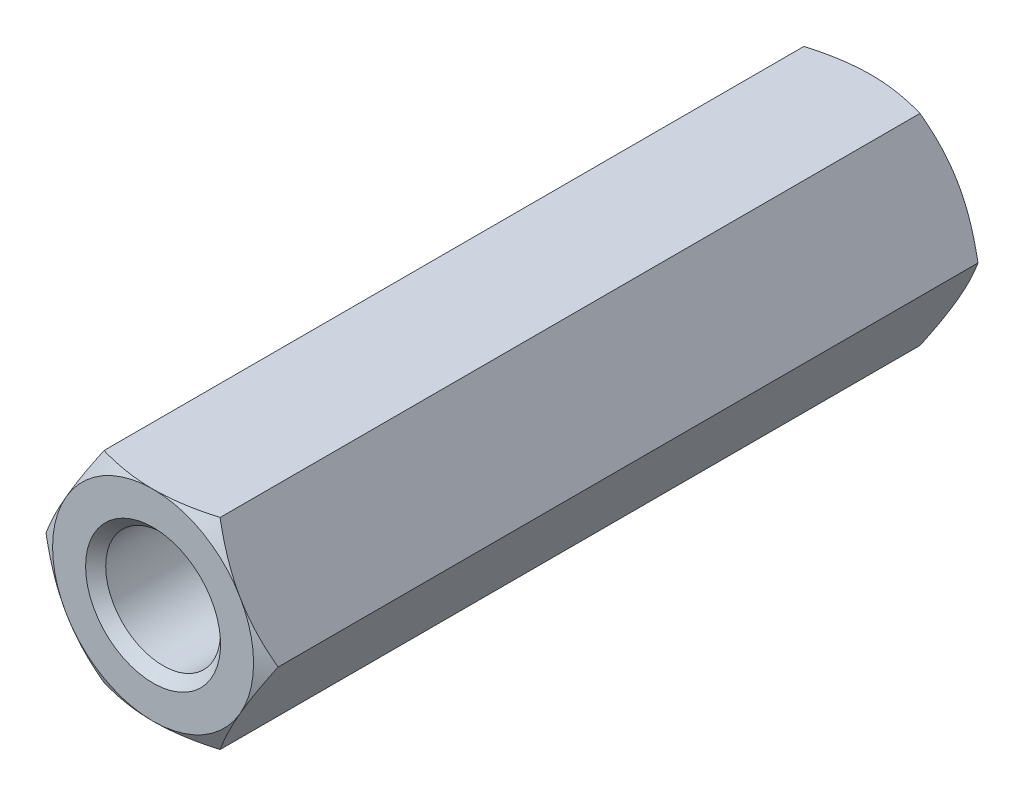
ISO-10303-21;
HEADER;
FILE_DESCRIPTION(('STEP AP214'),'2;1');
FILE_NAME('part.step','',(''),(''),'','','');
FILE_SCHEMA(('AUTOMOTIVE_DESIGN { 1 0 10303 214 1 1 1 1 }'));
ENDSEC;
DATA;
#1=APPLICATION_CONTEXT('core data for automotive mechanical design processes');
#2=APPLICATION_PROTOCOL_DEFINITION('international standard','automotive_design',2000,#1);
#3=PRODUCT_CONTEXT('',#1,'mechanical');
#4=PRODUCT('Part','Part','',(#3));
#5=PRODUCT_RELATED_PRODUCT_CATEGORY('part','',(#4));
#6=PRODUCT_DEFINITION_FORMATION('','',#4);
#7=PRODUCT_DEFINITION_CONTEXT('part definition',#1,'design');
#8=PRODUCT_DEFINITION('design','',#6,#7);
#9=PRODUCT_DEFINITION_SHAPE('','',#8);
#10=(LENGTH_UNIT() NAMED_UNIT(*) SI_UNIT(.MILLI.,.METRE.));
#11=(NAMED_UNIT(*) PLANE_ANGLE_UNIT() SI_UNIT($,.RADIAN.));
#12=(NAMED_UNIT(*) SI_UNIT($,.STERADIAN.) SOLID_ANGLE_UNIT());
#13=UNCERTAINTY_MEASURE_WITH_UNIT(LENGTH_MEASURE(1.E-05),#10,'distance_accuracy_value','');
#14=(GEOMETRIC_REPRESENTATION_CONTEXT(3) GLOBAL_UNCERTAINTY_ASSIGNED_CONTEXT((#13)) GLOBAL_UNIT_ASSIGNED_CONTEXT((#10,
#11,#12)) REPRESENTATION_CONTEXT('',''));
#15=CARTESIAN_POINT('',(0.,0.,0.));
#16=DIRECTION('',(0.,0.,1.));
#17=DIRECTION('',(1.,0.,0.));
#18=AXIS2_PLACEMENT_3D('',#15,#16,#17);
#19=CARTESIAN_POINT('',(4.04145188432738,0.,-12.5));
#20=DIRECTION('',(0.866025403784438,0.5,0.));
#21=DIRECTION('',(-0.5,0.866025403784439,0.));
#22=AXIS2_PLACEMENT_3D('',#19,#20,#21);
#23=PLANE('',#22);
#24=CARTESIAN_POINT('',(4.04156735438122,-0.00019999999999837,12.1873259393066));
#25=CARTESIAN_POINT('',(3.9527667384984,0.153607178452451,12.23861421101));
#26=CARTESIAN_POINT('',(3.86319960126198,0.308742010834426,12.2852590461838));
#27=CARTESIAN_POINT('',(3.68251437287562,0.621698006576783,12.3666781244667));
#28=CARTESIAN_POINT('',(3.59139307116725,0.779524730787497,12.4014235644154));
#29=CARTESIAN_POINT('',(3.41027974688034,1.09322221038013,12.4555099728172));
#30=CARTESIAN_POINT('',(3.32031559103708,1.24904469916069,12.4752109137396));
#31=CARTESIAN_POINT('',(3.13996396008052,1.56142288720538,12.4987298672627));
#32=CARTESIAN_POINT('',(3.04957714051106,1.71797745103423,12.5025673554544));
#33=CARTESIAN_POINT('',(2.88068384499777,2.01050921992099,12.494584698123));
#34=CARTESIAN_POINT('',(2.80215208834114,2.14653021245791,12.4847245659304));
#35=CARTESIAN_POINT('',(2.64560020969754,2.417686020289,12.4534735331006));
#36=CARTESIAN_POINT('',(2.5675806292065,2.55281989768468,12.4320719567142));
#37=CARTESIAN_POINT('',(2.41070596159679,2.82453479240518,12.3785695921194));
#38=CARTESIAN_POINT('',(2.33187072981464,2.96108141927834,12.3462420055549));
#39=CARTESIAN_POINT('',(2.17537608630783,3.2321380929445,12.272871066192));
#40=CARTESIAN_POINT('',(2.09771466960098,3.36665161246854,12.2318449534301));
#41=CARTESIAN_POINT('',(2.02061047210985,3.5002,12.1873259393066));
#42=B_SPLINE_CURVE_WITH_KNOTS('',3,(#24,#25,#26,#27,#28,#29,#30,#31,#32,#33,#34,#35,#36,#37,#38,
#39,#40,#41),.UNSPECIFIED.,.F.,.F.,(4,2,2,2,2,2,2,2,4),(0.,0.554793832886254,1.11092123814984,
1.65328467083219,2.19498204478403,2.6666513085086,3.13875761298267,3.62133612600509,
4.10296698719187),.UNSPECIFIED.);
#43=CARTESIAN_POINT('',(4.04145188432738,0.,12.1873926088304));
#44=VERTEX_POINT('',#43);
#45=CARTESIAN_POINT('',(3.03108891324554,1.75,12.5));
#46=VERTEX_POINT('',#45);
#47=EDGE_CURVE('E171',#44,#46,#42,.T.);
#48=ORIENTED_EDGE('',*,*,#47,.F.);
#49=DIRECTION('',(0.,0.,1.));
#50=VECTOR('',#49,1.);
#51=CARTESIAN_POINT('',(4.04145188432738,0.,-12.5));
#52=LINE('',#51,#50);
#53=CARTESIAN_POINT('',(4.04145188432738,0.,-12.1873926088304));
#54=VERTEX_POINT('',#53);
#55=EDGE_CURVE('E320',#54,#44,#52,.T.);
#56=ORIENTED_EDGE('',*,*,#55,.F.);
#57=CARTESIAN_POINT('',(4.04156735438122,-0.00019999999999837,-12.1873259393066));
#58=CARTESIAN_POINT('',(3.9527667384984,0.153607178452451,-12.23861421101));
#59=CARTESIAN_POINT('',(3.86319960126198,0.308742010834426,-12.2852590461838));
#60=CARTESIAN_POINT('',(3.68251437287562,0.621698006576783,-12.3666781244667));
#61=CARTESIAN_POINT('',(3.59139307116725,0.779524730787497,-12.4014235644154));
#62=CARTESIAN_POINT('',(3.41027974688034,1.09322221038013,-12.4555099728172));
#63=CARTESIAN_POINT('',(3.32031559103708,1.24904469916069,-12.4752109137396));
#64=CARTESIAN_POINT('',(3.13996396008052,1.56142288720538,-12.4987298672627));
#65=CARTESIAN_POINT('',(3.04957714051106,1.71797745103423,-12.5025673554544));
#66=CARTESIAN_POINT('',(2.88068384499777,2.01050921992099,-12.494584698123));
#67=CARTESIAN_POINT('',(2.80215208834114,2.14653021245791,-12.4847245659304));
#68=CARTESIAN_POINT('',(2.64560020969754,2.417686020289,-12.4534735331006));
#69=CARTESIAN_POINT('',(2.5675806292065,2.55281989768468,-12.4320719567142));
#70=CARTESIAN_POINT('',(2.41070596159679,2.82453479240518,-12.3785695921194));
#71=CARTESIAN_POINT('',(2.33187072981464,2.96108141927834,-12.3462420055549));
#72=CARTESIAN_POINT('',(2.17537608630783,3.2321380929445,-12.272871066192));
#73=CARTESIAN_POINT('',(2.09771466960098,3.36665161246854,-12.2318449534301));
#74=CARTESIAN_POINT('',(2.02061047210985,3.5002,-12.1873259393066));
#75=B_SPLINE_CURVE_WITH_KNOTS('',3,(#57,#58,#59,#60,#61,#62,#63,#64,#65,#66,#67,#68,#69,#70,#71,
#72,#73,#74),.UNSPECIFIED.,.F.,.F.,(4,2,2,2,2,2,2,2,4),(0.,0.554793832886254,1.11092123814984,
1.65328467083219,2.19498204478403,2.6666513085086,3.13875761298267,3.62133612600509,
4.10296698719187),.UNSPECIFIED.);
#76=CARTESIAN_POINT('',(3.03108891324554,1.75,-12.5));
#77=VERTEX_POINT('',#76);
#78=EDGE_CURVE('E304',#54,#77,#75,.T.);
#79=ORIENTED_EDGE('',*,*,#78,.T.);
#80=CARTESIAN_POINT('',(2.02072594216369,3.5,-12.1873926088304));
#81=VERTEX_POINT('',#80);
#82=EDGE_CURVE('E252',#77,#81,#75,.T.);
#83=ORIENTED_EDGE('',*,*,#82,.T.);
#84=DIRECTION('',(0.,0.,1.));
#85=VECTOR('',#84,1.);
#86=CARTESIAN_POINT('',(2.02072594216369,3.5,-12.5));
#87=LINE('',#86,#85);
#88=CARTESIAN_POINT('',(2.02072594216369,3.5,12.1873926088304));
#89=VERTEX_POINT('',#88);
#90=EDGE_CURVE('E351',#81,#89,#87,.T.);
#91=ORIENTED_EDGE('',*,*,#90,.T.);
#92=EDGE_CURVE('E147',#46,#89,#42,.T.);
#93=ORIENTED_EDGE('',*,*,#92,.F.);
#94=EDGE_LOOP('',(#48,#56,#79,#83,#91,#93));
#95=FACE_BOUND('',#94,.T.);
#96=ADVANCED_FACE('F41',(#95),#23,.T.);
#97=CARTESIAN_POINT('',(2.02072594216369,-3.5,-12.5));
#98=DIRECTION('',(0.866025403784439,-0.5,0.));
#99=DIRECTION('',(0.5,0.866025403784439,0.));
#100=AXIS2_PLACEMENT_3D('',#97,#98,#99);
#101=PLANE('',#100);
#102=CARTESIAN_POINT('',(2.02061047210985,-3.5002,12.1873259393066));
#103=CARTESIAN_POINT('',(2.10941108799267,-3.34639282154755,12.23861421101));
#104=CARTESIAN_POINT('',(2.19897822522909,-3.19125798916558,12.2852590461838));
#105=CARTESIAN_POINT('',(2.37966345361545,-2.87830199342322,12.3666781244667));
#106=CARTESIAN_POINT('',(2.47078475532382,-2.7204752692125,12.4014235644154));
#107=CARTESIAN_POINT('',(2.65189807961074,-2.40677778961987,12.4555099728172));
#108=CARTESIAN_POINT('',(2.74186223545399,-2.25095530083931,12.4752109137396));
#109=CARTESIAN_POINT('',(2.92221386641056,-1.93857711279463,12.4987298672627));
#110=CARTESIAN_POINT('',(3.01260068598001,-1.78202254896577,12.5025673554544));
#111=CARTESIAN_POINT('',(3.1814939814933,-1.48949078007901,12.494584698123));
#112=CARTESIAN_POINT('',(3.26002573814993,-1.35346978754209,12.4847245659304));
#113=CARTESIAN_POINT('',(3.41657761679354,-1.082313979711,12.4534735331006));
#114=CARTESIAN_POINT('',(3.49459719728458,-0.947180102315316,12.4320719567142));
#115=CARTESIAN_POINT('',(3.65147186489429,-0.675465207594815,12.3785695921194));
#116=CARTESIAN_POINT('',(3.73030709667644,-0.538918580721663,12.3462420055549));
#117=CARTESIAN_POINT('',(3.88680174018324,-0.267861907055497,12.272871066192));
#118=CARTESIAN_POINT('',(3.96446315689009,-0.133348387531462,12.2318449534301));
#119=CARTESIAN_POINT('',(4.04156735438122,0.000200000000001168,12.1873259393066));
#120=B_SPLINE_CURVE_WITH_KNOTS('',3,(#102,#103,#104,#105,#106,#107,#108,#109,#110,#111,#112,
#113,#114,#115,#116,#117,#118,#119),.UNSPECIFIED.,.F.,.F.,(4,2,2,2,2,2,2,2,4),(0.,
0.554793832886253,1.11092123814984,1.65328467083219,2.19498204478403,2.6666513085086,
3.13875761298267,3.6213361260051,4.10296698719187),.UNSPECIFIED.);
#121=CARTESIAN_POINT('',(2.02072594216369,-3.5,12.1873926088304));
#122=VERTEX_POINT('',#121);
#123=CARTESIAN_POINT('',(3.03108891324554,-1.75,12.5));
#124=VERTEX_POINT('',#123);
#125=EDGE_CURVE('E391',#122,#124,#120,.T.);
#126=ORIENTED_EDGE('',*,*,#125,.F.);
#127=DIRECTION('',(0.,0.,1.));
#128=VECTOR('',#127,1.);
#129=CARTESIAN_POINT('',(2.02072594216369,-3.5,-12.5));
#130=LINE('',#129,#128);
#131=CARTESIAN_POINT('',(2.02072594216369,-3.5,-12.1873926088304));
#132=VERTEX_POINT('',#131);
#133=EDGE_CURVE('E467',#132,#122,#130,.T.);
#134=ORIENTED_EDGE('',*,*,#133,.F.);
#135=CARTESIAN_POINT('',(2.02061047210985,-3.5002,-12.1873259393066));
#136=CARTESIAN_POINT('',(2.10941108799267,-3.34639282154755,-12.23861421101));
#137=CARTESIAN_POINT('',(2.19897822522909,-3.19125798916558,-12.2852590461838));
#138=CARTESIAN_POINT('',(2.37966345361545,-2.87830199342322,-12.3666781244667));
#139=CARTESIAN_POINT('',(2.47078475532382,-2.7204752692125,-12.4014235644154));
#140=CARTESIAN_POINT('',(2.65189807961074,-2.40677778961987,-12.4555099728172));
#141=CARTESIAN_POINT('',(2.74186223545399,-2.25095530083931,-12.4752109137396));
#142=CARTESIAN_POINT('',(2.92221386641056,-1.93857711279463,-12.4987298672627));
#143=CARTESIAN_POINT('',(3.01260068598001,-1.78202254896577,-12.5025673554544));
#144=CARTESIAN_POINT('',(3.1814939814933,-1.48949078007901,-12.494584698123));
#145=CARTESIAN_POINT('',(3.26002573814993,-1.35346978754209,-12.4847245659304));
#146=CARTESIAN_POINT('',(3.41657761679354,-1.082313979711,-12.4534735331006));
#147=CARTESIAN_POINT('',(3.49459719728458,-0.947180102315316,-12.4320719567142));
#148=CARTESIAN_POINT('',(3.65147186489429,-0.675465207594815,-12.3785695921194));
#149=CARTESIAN_POINT('',(3.73030709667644,-0.538918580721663,-12.3462420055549));
#150=CARTESIAN_POINT('',(3.88680174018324,-0.267861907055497,-12.272871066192));
#151=CARTESIAN_POINT('',(3.96446315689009,-0.133348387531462,-12.2318449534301));
#152=CARTESIAN_POINT('',(4.04156735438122,0.000200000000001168,-12.1873259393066));
#153=B_SPLINE_CURVE_WITH_KNOTS('',3,(#135,#136,#137,#138,#139,#140,#141,#142,#143,#144,#145,
#146,#147,#148,#149,#150,#151,#152),.UNSPECIFIED.,.F.,.F.,(4,2,2,2,2,2,2,2,4),(0.,
0.554793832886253,1.11092123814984,1.65328467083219,2.19498204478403,2.6666513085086,
3.13875761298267,3.6213361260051,4.10296698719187),.UNSPECIFIED.);
#154=CARTESIAN_POINT('',(3.03108891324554,-1.75,-12.5));
#155=VERTEX_POINT('',#154);
#156=EDGE_CURVE('E335',#132,#155,#153,.T.);
#157=ORIENTED_EDGE('',*,*,#156,.T.);
#158=EDGE_CURVE('E249',#155,#54,#153,.T.);
#159=ORIENTED_EDGE('',*,*,#158,.T.);
#160=ORIENTED_EDGE('',*,*,#55,.T.);
#161=EDGE_CURVE('E175',#124,#44,#120,.T.);
#162=ORIENTED_EDGE('',*,*,#161,.F.);
#163=EDGE_LOOP('',(#126,#134,#157,#159,#160,#162));
#164=FACE_BOUND('',#163,.T.);
#165=ADVANCED_FACE('F332',(#164),#101,.T.);
#166=CARTESIAN_POINT('',(-2.02072594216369,-3.5,-12.5));
#167=DIRECTION('',(0.,-1.,0.));
#168=DIRECTION('',(1.,0.,0.));
#169=AXIS2_PLACEMENT_3D('',#166,#167,#168);
#170=PLANE('',#169);
#171=CARTESIAN_POINT('',(-20.6164736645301,-3.50000000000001,2.4474912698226));
#172=CARTESIAN_POINT('',(-20.1738338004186,-3.50000000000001,2.6994392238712));
#173=CARTESIAN_POINT('',(-19.7311005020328,-3.50000000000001,2.95122323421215));
#174=CARTESIAN_POINT('',(-18.8453950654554,-3.50000000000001,3.45437206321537));
#175=CARTESIAN_POINT('',(-18.4024229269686,-3.50000000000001,3.70573688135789));
#176=CARTESIAN_POINT('',(-17.5161499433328,-3.50000000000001,4.20797749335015));
#177=CARTESIAN_POINT('',(-17.0728490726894,-3.50000000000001,4.45885324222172));
#178=CARTESIAN_POINT('',(-16.1858853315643,-3.50000000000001,4.95996363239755));
#179=CARTESIAN_POINT('',(-15.7422224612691,-3.50000000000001,5.21019827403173));
#180=CARTESIAN_POINT('',(-14.8559724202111,-3.50000000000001,5.7089880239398));
#181=CARTESIAN_POINT('',(-14.4133868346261,-3.50000000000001,5.95754594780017));
#182=CARTESIAN_POINT('',(-13.5276266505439,-3.50000000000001,6.4536099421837));
#183=CARTESIAN_POINT('',(-13.0844520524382,-3.5,6.70111601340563));
#184=CARTESIAN_POINT('',(-12.1973492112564,-3.5,7.19471521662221));
#185=CARTESIAN_POINT('',(-11.7534210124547,-3.5,7.44080842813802));
#186=CARTESIAN_POINT('',(-10.8645093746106,-3.5,7.93108146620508));
#187=CARTESIAN_POINT('',(-10.419525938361,-3.5,8.17526129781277));
#188=CARTESIAN_POINT('',(-9.52358857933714,-3.5,8.66335192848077));
#189=CARTESIAN_POINT('',(-9.07261966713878,-3.5,8.90723524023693));
#190=CARTESIAN_POINT('',(-8.16843578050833,-3.5,9.39093978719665));
#191=CARTESIAN_POINT('',(-7.71522057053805,-3.5,9.63076058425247));
#192=CARTESIAN_POINT('',(-7.03214337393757,-3.5,9.98599431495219));
#193=CARTESIAN_POINT('',(-6.80354651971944,-3.5,10.1038377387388));
#194=CARTESIAN_POINT('',(-6.34527043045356,-3.5,10.3373934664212));
#195=CARTESIAN_POINT('',(-6.11559121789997,-3.5,10.4531058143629));
#196=CARTESIAN_POINT('',(-5.65488500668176,-3.5,10.6817220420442));
#197=CARTESIAN_POINT('',(-5.42385824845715,-3.5,10.7946264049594));
#198=CARTESIAN_POINT('',(-4.96001187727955,-3.5,11.0166858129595));
#199=CARTESIAN_POINT('',(-4.72719232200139,-3.5,11.1258409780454));
#200=CARTESIAN_POINT('',(-4.24774946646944,-3.5,11.3442202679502));
#201=CARTESIAN_POINT('',(-4.00100798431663,-3.5,11.4531866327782));
#202=CARTESIAN_POINT('',(-3.50411224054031,-3.5,11.6629852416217));
#203=CARTESIAN_POINT('',(-3.2539587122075,-3.5,11.7638192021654));
#204=CARTESIAN_POINT('',(-2.74997510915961,-3.5,11.9532478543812));
#205=CARTESIAN_POINT('',(-2.49616063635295,-3.5,12.0418834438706));
#206=CARTESIAN_POINT('',(-1.98298893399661,-3.5,12.2015556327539));
#207=CARTESIAN_POINT('',(-1.72363454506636,-3.5,12.2726010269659));
#208=CARTESIAN_POINT('',(-1.27074928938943,-3.5,12.3733271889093));
#209=CARTESIAN_POINT('',(-1.07857754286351,-3.5,12.4090055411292));
#210=CARTESIAN_POINT('',(-0.691884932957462,-3.5,12.463732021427));
#211=CARTESIAN_POINT('',(-0.497365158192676,-3.5,12.482787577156));
#212=CARTESIAN_POINT('',(-0.107998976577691,-3.5,12.5021278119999));
#213=CARTESIAN_POINT('',(0.0868443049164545,-3.5,12.5024734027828));
#214=CARTESIAN_POINT('',(0.475691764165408,-3.5,12.4844975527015));
#215=CARTESIAN_POINT('',(0.669695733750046,-3.5,12.4661717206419));
#216=CARTESIAN_POINT('',(1.00276334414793,-3.5,12.4201792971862));
#217=CARTESIAN_POINT('',(1.14239363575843,-3.5,12.3964183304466));
#218=CARTESIAN_POINT('',(1.42016190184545,-3.5,12.3412874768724));
#219=CARTESIAN_POINT('',(1.55829957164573,-3.5,12.3099160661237));
#220=CARTESIAN_POINT('',(1.83308294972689,-3.5,12.2407498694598));
#221=CARTESIAN_POINT('',(1.96972702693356,-3.5,12.2029486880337));
#222=CARTESIAN_POINT('',(2.24142925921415,-3.5,12.1220837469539));
#223=CARTESIAN_POINT('',(2.37648748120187,-3.5,12.0790202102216));
#224=CARTESIAN_POINT('',(2.64672040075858,-3.5,11.9880769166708));
#225=CARTESIAN_POINT('',(2.78187802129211,-3.5,11.9401467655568));
#226=CARTESIAN_POINT('',(3.0508720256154,-3.5,11.8407293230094));
#227=CARTESIAN_POINT('',(3.18470840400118,-3.5,11.7892420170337));
#228=CARTESIAN_POINT('',(3.45114850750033,-3.5,11.6834099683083));
#229=CARTESIAN_POINT('',(3.58375292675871,-3.5,11.6290669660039));
#230=CARTESIAN_POINT('',(3.84796417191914,-3.5,11.5180254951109));
#231=CARTESIAN_POINT('',(3.97957102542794,-3.5,11.4613270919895));
#232=CARTESIAN_POINT('',(4.26668311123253,-3.5,11.3351148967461));
#233=CARTESIAN_POINT('',(4.42201238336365,-3.5,11.2652015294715));
#234=CARTESIAN_POINT('',(4.73166791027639,-3.5,11.1231843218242));
#235=CARTESIAN_POINT('',(4.88599413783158,-3.5,11.0510804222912));
#236=CARTESIAN_POINT('',(5.34775463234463,-3.5,10.832119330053));
#237=CARTESIAN_POINT('',(5.65393855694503,-3.5,10.6826271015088));
#238=CARTESIAN_POINT('',(6.26406090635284,-3.5,10.3788767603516));
#239=CARTESIAN_POINT('',(6.56799843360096,-3.5,10.2246168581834));
#240=CARTESIAN_POINT('',(7.17416646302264,-3.5,9.9127704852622));
#241=CARTESIAN_POINT('',(7.47639693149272,-3.5,9.75518394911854));
#242=CARTESIAN_POINT('',(8.07993173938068,-3.5,9.43742093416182));
#243=CARTESIAN_POINT('',(8.38123462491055,-3.5,9.2772417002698));
#244=CARTESIAN_POINT('',(8.98287517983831,-3.5,8.95507347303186));
#245=CARTESIAN_POINT('',(9.28321283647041,-3.5,8.79308445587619));
#246=CARTESIAN_POINT('',(10.1829693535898,-3.5,8.30515046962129));
#247=CARTESIAN_POINT('',(10.7812785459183,-3.5,7.97716068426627));
#248=CARTESIAN_POINT('',(11.973016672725,-3.5,7.31949890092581));
#249=CARTESIAN_POINT('',(12.5664549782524,-3.5,6.98984383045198));
#250=CARTESIAN_POINT('',(13.7521278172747,-3.5,6.32829414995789));
#251=CARTESIAN_POINT('',(14.3443622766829,-3.5,5.99639940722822));
#252=CARTESIAN_POINT('',(15.5276621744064,-3.5,5.33123635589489));
#253=CARTESIAN_POINT('',(16.1187280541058,-3.5,4.99796883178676));
#254=CARTESIAN_POINT('',(17.3002206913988,-3.5,4.33032217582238));
#255=CARTESIAN_POINT('',(17.8906474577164,-3.5,3.99594305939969));
#256=CARTESIAN_POINT('',(18.658795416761,-3.49999999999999,3.560197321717));
#257=CARTESIAN_POINT('',(18.8367317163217,-3.49999999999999,3.45920965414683));
#258=CARTESIAN_POINT('',(19.1925743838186,-3.49999999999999,3.25715826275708));
#259=CARTESIAN_POINT('',(19.3704807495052,-3.49999999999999,3.15609453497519));
#260=CARTESIAN_POINT('',(19.7264262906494,-3.49999999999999,2.95380601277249));
#261=CARTESIAN_POINT('',(19.9044654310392,-3.49999999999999,2.85258115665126));
#262=CARTESIAN_POINT('',(20.2604995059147,-3.49999999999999,2.65007715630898));
#263=CARTESIAN_POINT('',(20.4384944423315,-3.49999999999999,2.54879801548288));
#264=CARTESIAN_POINT('',(20.6164736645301,-3.49999999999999,2.4474912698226));
#265=B_SPLINE_CURVE_WITH_KNOTS('',3,(#171,#172,#173,#174,#175,#176,#177,#178,#179,#180,#181,
#182,#183,#184,#185,#186,#187,#188,#189,#190,#191,#192,#193,#194,#195,#196,#197,#198,#199,#200,
#201,#202,#203,#204,#205,#206,#207,#208,#209,#210,#211,#212,#213,#214,#215,#216,#217,#218,#219,
#220,#221,#222,#223,#224,#225,#226,#227,#228,#229,#230,#231,#232,#233,#234,#235,#236,#237,#238,
#239,#240,#241,#242,#243,#244,#245,#246,#247,#248,#249,#250,#251,#252,#253,#254,#255,#256,#257,
#258,#259,#260,#261,#262,#263,#264),.UNSPECIFIED.,.F.,.F.,(4,2,2,2,2,2,2,2,2,2,2,2,2,2,2,2,2,2,
2,2,2,2,2,2,2,2,2,2,2,2,2,2,2,2,2,2,2,2,2,2,2,2,2,2,2,2,4),(0.,1.52796294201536,
3.05592777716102,4.58402706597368,6.11212556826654,7.63494011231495,9.15775364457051,
10.6804806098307,12.2032035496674,13.7412653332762,15.2794919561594,16.0510357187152,
16.8225635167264,17.5939576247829,18.3653270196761,19.1744250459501,19.9833518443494,
20.789496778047,21.5952378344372,22.1810167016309,22.766533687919,23.350144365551,
23.9338923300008,24.3585852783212,24.783363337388,25.2085664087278,25.6337514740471,
26.0639044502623,26.4940591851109,26.9239547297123,27.3538383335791,27.864830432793,
28.3758363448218,29.3979537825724,30.4204596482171,31.4429856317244,32.4666806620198,
33.4903891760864,35.5373077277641,37.5738615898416,39.6105372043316,41.6461769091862,
43.6817884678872,44.2955787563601,44.9094036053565,45.5238136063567,46.1381888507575),.UNSPECIFIED.);
#266=CARTESIAN_POINT('',(-2.02072594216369,-3.5,12.1873926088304));
#267=VERTEX_POINT('',#266);
#268=CARTESIAN_POINT('',(0.,-3.5,12.5));
#269=VERTEX_POINT('',#268);
#270=EDGE_CURVE('E393',#267,#269,#265,.T.);
#271=ORIENTED_EDGE('',*,*,#270,.F.);
#272=DIRECTION('',(0.,0.,1.));
#273=VECTOR('',#272,1.);
#274=CARTESIAN_POINT('',(-2.02072594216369,-3.5,-12.5));
#275=LINE('',#274,#273);
#276=CARTESIAN_POINT('',(-2.02072594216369,-3.5,-12.1873926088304));
#277=VERTEX_POINT('',#276);
#278=EDGE_CURVE('E468',#277,#267,#275,.T.);
#279=ORIENTED_EDGE('',*,*,#278,.F.);
#280=CARTESIAN_POINT('',(-12.3225099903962,-3.5,-7.12491062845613));
#281=CARTESIAN_POINT('',(-12.051589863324,-3.5,-7.27536651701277));
#282=CARTESIAN_POINT('',(-11.7805188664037,-3.5,-7.42555165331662));
#283=CARTESIAN_POINT('',(-11.237993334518,-3.5,-7.72523305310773));
#284=CARTESIAN_POINT('',(-10.9665387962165,-3.5,-7.8747293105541));
#285=CARTESIAN_POINT('',(-10.4230665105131,-3.5,-8.17293925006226));
#286=CARTESIAN_POINT('',(-10.151048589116,-3.5,-8.32165261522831));
#287=CARTESIAN_POINT('',(-9.60644261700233,-3.5,-8.61802999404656));
#288=CARTESIAN_POINT('',(-9.33385456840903,-3.5,-8.76569401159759));
#289=CARTESIAN_POINT('',(-8.78565985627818,-3.5,-9.0609343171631));
#290=CARTESIAN_POINT('',(-8.51004712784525,-3.5,-9.20849935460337));
#291=CARTESIAN_POINT('',(-7.95789334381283,-3.5,-9.50188186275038));
#292=CARTESIAN_POINT('',(-7.68135229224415,-3.5,-9.64769934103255));
#293=CARTESIAN_POINT('',(-7.12711045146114,-3.5,-9.93699889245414));
#294=CARTESIAN_POINT('',(-6.8494098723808,-3.5,-10.0804813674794));
#295=CARTESIAN_POINT('',(-6.29241447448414,-3.5,-10.3643132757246));
#296=CARTESIAN_POINT('',(-6.01311969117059,-3.5,-10.5046627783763));
#297=CARTESIAN_POINT('',(-5.45075140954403,-3.5,-10.781783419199));
#298=CARTESIAN_POINT('',(-5.16766540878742,-3.5,-10.9185292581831));
#299=CARTESIAN_POINT('',(-4.59840709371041,-3.5,-11.1856760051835));
#300=CARTESIAN_POINT('',(-4.31223413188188,-3.5,-11.3160755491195));
#301=CARTESIAN_POINT('',(-3.87966872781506,-3.5,-11.5044939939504));
#302=CARTESIAN_POINT('',(-3.73485528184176,-3.5,-11.5661326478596));
#303=CARTESIAN_POINT('',(-3.44397699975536,-3.5,-11.6863748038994));
#304=CARTESIAN_POINT('',(-3.29791222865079,-3.5,-11.7449784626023));
#305=CARTESIAN_POINT('',(-3.00433614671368,-3.5,-11.8583875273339));
#306=CARTESIAN_POINT('',(-2.85682509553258,-3.5,-11.9131936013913));
#307=CARTESIAN_POINT('',(-2.56012278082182,-3.5,-12.0180291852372));
#308=CARTESIAN_POINT('',(-2.41093168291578,-3.5,-12.0680591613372));
#309=CARTESIAN_POINT('',(-2.06497842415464,-3.5,-12.1764396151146));
#310=CARTESIAN_POINT('',(-1.86754788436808,-3.5,-12.2326930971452));
#311=CARTESIAN_POINT('',(-1.46924363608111,-3.5,-12.331625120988));
#312=CARTESIAN_POINT('',(-1.26837066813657,-3.5,-12.3743065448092));
#313=CARTESIAN_POINT('',(-0.965807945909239,-3.5,-12.4252093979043));
#314=CARTESIAN_POINT('',(-0.865202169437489,-3.5,-12.4399529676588));
#315=CARTESIAN_POINT('',(-0.663425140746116,-3.5,-12.4648053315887));
#316=CARTESIAN_POINT('',(-0.562253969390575,-3.5,-12.474914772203));
#317=CARTESIAN_POINT('',(-0.35955009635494,-3.5,-12.4901938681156));
#318=CARTESIAN_POINT('',(-0.258017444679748,-3.5,-12.4953641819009));
#319=CARTESIAN_POINT('',(-0.0548198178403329,-3.5,-12.5006018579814));
#320=CARTESIAN_POINT('',(0.0468451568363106,-3.5,-12.5006692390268));
#321=CARTESIAN_POINT('',(0.249805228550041,-3.5,-12.4957032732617));
#322=CARTESIAN_POINT('',(0.351100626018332,-3.5,-12.490682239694));
#323=CARTESIAN_POINT('',(0.553331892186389,-3.5,-12.4757237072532));
#324=CARTESIAN_POINT('',(0.654267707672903,-3.5,-12.4657855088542));
#325=CARTESIAN_POINT('',(0.956246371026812,-3.5,-12.4290146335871));
#326=CARTESIAN_POINT('',(1.15647378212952,-3.5,-12.3952252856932));
#327=CARTESIAN_POINT('',(1.45639598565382,-3.5,-12.3327212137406));
#328=CARTESIAN_POINT('',(1.55733614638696,-3.5,-12.3096154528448));
#329=CARTESIAN_POINT('',(1.75836610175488,-3.5,-12.2599285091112));
#330=CARTESIAN_POINT('',(1.85845588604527,-3.5,-12.2333472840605));
#331=CARTESIAN_POINT('',(2.05777507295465,-3.5,-12.1771628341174));
#332=CARTESIAN_POINT('',(2.1570044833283,-3.5,-12.1475596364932));
#333=CARTESIAN_POINT('',(2.35463617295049,-3.5,-12.0857428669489));
#334=CARTESIAN_POINT('',(2.45303850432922,-3.5,-12.0535294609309));
#335=CARTESIAN_POINT('',(2.78211659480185,-3.5,-11.9416318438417));
#336=CARTESIAN_POINT('',(3.01106290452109,-3.5,-11.8568555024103));
#337=CARTESIAN_POINT('',(3.46557674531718,-3.5,-11.6786341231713));
#338=CARTESIAN_POINT('',(3.69114312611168,-3.5,-11.5851862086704));
#339=CARTESIAN_POINT('',(4.13985611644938,-3.5,-11.3920386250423));
#340=CARTESIAN_POINT('',(4.3629998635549,-3.5,-11.2923323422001));
#341=CARTESIAN_POINT('',(4.80720050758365,-3.5,-11.08847455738));
#342=CARTESIAN_POINT('',(5.02825766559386,-3.5,-10.9843236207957));
#343=CARTESIAN_POINT('',(5.46964033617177,-3.5,-10.772307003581));
#344=CARTESIAN_POINT('',(5.68995962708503,-3.5,-10.6644284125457));
#345=CARTESIAN_POINT('',(6.12935127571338,-3.5,-10.4461531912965));
#346=CARTESIAN_POINT('',(6.34842360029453,-3.5,-10.3357564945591));
#347=CARTESIAN_POINT('',(6.78544414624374,-3.5,-10.1130923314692));
#348=CARTESIAN_POINT('',(7.0033929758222,-3.5,-10.0008260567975));
#349=CARTESIAN_POINT('',(7.43849960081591,-3.5,-9.77476984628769));
#350=CARTESIAN_POINT('',(7.65565739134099,-3.5,-9.66097990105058));
#351=CARTESIAN_POINT('',(8.24725321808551,-3.5,-9.34888265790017));
#352=CARTESIAN_POINT('',(8.62105800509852,-3.5,-9.14937559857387));
#353=CARTESIAN_POINT('',(9.36737702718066,-3.5,-8.74781326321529));
#354=CARTESIAN_POINT('',(9.73989102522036,-3.5,-8.54575754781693));
#355=CARTESIAN_POINT('',(10.4812081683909,-3.5,-8.1413043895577));
#356=CARTESIAN_POINT('',(10.8500185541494,-3.5,-7.93892020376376));
#357=CARTESIAN_POINT('',(11.586811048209,-3.5,-7.53281880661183));
#358=CARTESIAN_POINT('',(11.9547933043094,-3.5,-7.32910186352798));
#359=CARTESIAN_POINT('',(12.3225099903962,-3.5,-7.12491062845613));
#360=B_SPLINE_CURVE_WITH_KNOTS('',3,(#280,#281,#282,#283,#284,#285,#286,#287,#288,#289,#290,
#291,#292,#293,#294,#295,#296,#297,#298,#299,#300,#301,#302,#303,#304,#305,#306,#307,#308,#309,
#310,#311,#312,#313,#314,#315,#316,#317,#318,#319,#320,#321,#322,#323,#324,#325,#326,#327,#328,
#329,#330,#331,#332,#333,#334,#335,#336,#337,#338,#339,#340,#341,#342,#343,#344,#345,#346,#347,
#348,#349,#350,#351,#352,#353,#354,#355,#356,#357,#358,#359),.UNSPECIFIED.,.F.,.F.,(4,2,2,2,2,2,
2,2,2,2,2,2,2,2,2,2,2,2,2,2,2,2,2,2,2,2,2,2,2,2,2,2,2,2,2,2,2,2,2,4),(0.,0.929684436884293,
1.85937701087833,2.78942071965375,3.71946097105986,4.65734769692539,5.59523035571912,
6.53294984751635,7.47064853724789,8.41375402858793,9.35706134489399,9.82919220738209,
10.3012986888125,10.7733219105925,11.2452989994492,11.8608181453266,12.4762064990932,
12.7811571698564,13.0860652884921,13.3909327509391,13.6957990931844,13.9999294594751,
14.3041031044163,14.9124104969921,15.223022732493,15.5336387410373,15.844251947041,
16.154845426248,16.8869640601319,17.6193264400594,18.3524762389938,19.0855330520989,
19.8214505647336,20.5573875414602,21.2928721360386,22.0283612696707,23.2994859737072,
24.5708328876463,25.8329009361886,27.094722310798),.UNSPECIFIED.);
#361=CARTESIAN_POINT('',(0.,-3.5,-12.5));
#362=VERTEX_POINT('',#361);
#363=EDGE_CURVE('E344',#277,#362,#360,.T.);
#364=ORIENTED_EDGE('',*,*,#363,.T.);
#365=EDGE_CURVE('E277',#362,#132,#360,.T.);
#366=ORIENTED_EDGE('',*,*,#365,.T.);
#367=ORIENTED_EDGE('',*,*,#133,.T.);
#368=EDGE_CURVE('E211',#269,#122,#265,.T.);
#369=ORIENTED_EDGE('',*,*,#368,.F.);
#370=EDGE_LOOP('',(#271,#279,#364,#366,#367,#369));
#371=FACE_BOUND('',#370,.T.);
#372=ADVANCED_FACE('F234',(#371),#170,.T.);
#373=CARTESIAN_POINT('',(-4.04145188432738,0.,-12.5));
#374=DIRECTION('',(-0.866025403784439,-0.5,0.));
#375=DIRECTION('',(0.5,-0.866025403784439,0.));
#376=AXIS2_PLACEMENT_3D('',#373,#374,#375);
#377=PLANE('',#376);
#378=CARTESIAN_POINT('',(-4.04156735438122,0.00019999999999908,12.1873259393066));
#379=CARTESIAN_POINT('',(-3.9527667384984,-0.15360717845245,12.23861421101));
#380=CARTESIAN_POINT('',(-3.86319960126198,-0.308742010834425,12.2852590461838));
#381=CARTESIAN_POINT('',(-3.68251437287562,-0.621698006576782,12.3666781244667));
#382=CARTESIAN_POINT('',(-3.59139307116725,-0.779524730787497,12.4014235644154));
#383=CARTESIAN_POINT('',(-3.41027974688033,-1.09322221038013,12.4555099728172));
#384=CARTESIAN_POINT('',(-3.32031559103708,-1.24904469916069,12.4752109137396));
#385=CARTESIAN_POINT('',(-3.13996396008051,-1.56142288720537,12.4987298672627));
#386=CARTESIAN_POINT('',(-3.04957714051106,-1.71797745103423,12.5025673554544));
#387=CARTESIAN_POINT('',(-2.88068384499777,-2.01050921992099,12.494584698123));
#388=CARTESIAN_POINT('',(-2.80215208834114,-2.14653021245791,12.4847245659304));
#389=CARTESIAN_POINT('',(-2.64560020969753,-2.41768602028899,12.4534735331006));
#390=CARTESIAN_POINT('',(-2.56758062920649,-2.55281989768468,12.4320719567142));
#391=CARTESIAN_POINT('',(-2.41070596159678,-2.82453479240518,12.3785695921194));
#392=CARTESIAN_POINT('',(-2.33187072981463,-2.96108141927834,12.3462420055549));
#393=CARTESIAN_POINT('',(-2.17537608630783,-3.2321380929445,12.272871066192));
#394=CARTESIAN_POINT('',(-2.09771466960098,-3.36665161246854,12.2318449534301));
#395=CARTESIAN_POINT('',(-2.02061047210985,-3.5002,12.1873259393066));
#396=B_SPLINE_CURVE_WITH_KNOTS('',3,(#378,#379,#380,#381,#382,#383,#384,#385,#386,#387,#388,
#389,#390,#391,#392,#393,#394,#395),.UNSPECIFIED.,.F.,.F.,(4,2,2,2,2,2,2,2,4),(0.,
0.554793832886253,1.11092123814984,1.65328467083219,2.19498204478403,2.6666513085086,
3.13875761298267,3.6213361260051,4.10296698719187),.UNSPECIFIED.);
#397=CARTESIAN_POINT('',(-4.04145188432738,0.,12.1873926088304));
#398=VERTEX_POINT('',#397);
#399=CARTESIAN_POINT('',(-3.03108891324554,-1.75,12.5));
#400=VERTEX_POINT('',#399);
#401=EDGE_CURVE('E156',#398,#400,#396,.T.);
#402=ORIENTED_EDGE('',*,*,#401,.F.);
#403=DIRECTION('',(0.,0.,1.));
#404=VECTOR('',#403,1.);
#405=CARTESIAN_POINT('',(-4.04145188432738,0.,-12.5));
#406=LINE('',#405,#404);
#407=CARTESIAN_POINT('',(-4.04145188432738,0.,-12.1873926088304));
#408=VERTEX_POINT('',#407);
#409=EDGE_CURVE('E169',#408,#398,#406,.T.);
#410=ORIENTED_EDGE('',*,*,#409,.F.);
#411=CARTESIAN_POINT('',(-4.04156735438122,0.000199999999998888,-12.1873259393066));
#412=CARTESIAN_POINT('',(-3.9527667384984,-0.15360717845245,-12.23861421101));
#413=CARTESIAN_POINT('',(-3.86319960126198,-0.308742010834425,-12.2852590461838));
#414=CARTESIAN_POINT('',(-3.68251437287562,-0.621698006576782,-12.3666781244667));
#415=CARTESIAN_POINT('',(-3.59139307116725,-0.779524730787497,-12.4014235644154));
#416=CARTESIAN_POINT('',(-3.41027974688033,-1.09322221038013,-12.4555099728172));
#417=CARTESIAN_POINT('',(-3.32031559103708,-1.24904469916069,-12.4752109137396));
#418=CARTESIAN_POINT('',(-3.13996396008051,-1.56142288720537,-12.4987298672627));
#419=CARTESIAN_POINT('',(-3.04957714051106,-1.71797745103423,-12.5025673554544));
#420=CARTESIAN_POINT('',(-2.88068384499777,-2.01050921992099,-12.494584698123));
#421=CARTESIAN_POINT('',(-2.80215208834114,-2.14653021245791,-12.4847245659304));
#422=CARTESIAN_POINT('',(-2.64560020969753,-2.417686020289,-12.4534735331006));
#423=CARTESIAN_POINT('',(-2.56758062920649,-2.55281989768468,-12.4320719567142));
#424=CARTESIAN_POINT('',(-2.41070596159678,-2.82453479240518,-12.3785695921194));
#425=CARTESIAN_POINT('',(-2.33187072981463,-2.96108141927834,-12.3462420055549));
#426=CARTESIAN_POINT('',(-2.17537608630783,-3.2321380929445,-12.272871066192));
#427=CARTESIAN_POINT('',(-2.09771466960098,-3.36665161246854,-12.2318449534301));
#428=CARTESIAN_POINT('',(-2.02061047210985,-3.5002,-12.1873259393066));
#429=B_SPLINE_CURVE_WITH_KNOTS('',3,(#411,#412,#413,#414,#415,#416,#417,#418,#419,#420,#421,
#422,#423,#424,#425,#426,#427,#428),.UNSPECIFIED.,.F.,.F.,(4,2,2,2,2,2,2,2,4),(0.,
0.554793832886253,1.11092123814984,1.65328467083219,2.19498204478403,2.6666513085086,
3.13875761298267,3.6213361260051,4.10296698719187),.UNSPECIFIED.);
#430=CARTESIAN_POINT('',(-3.03108891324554,-1.75,-12.5));
#431=VERTEX_POINT('',#430);
#432=EDGE_CURVE('E239',#408,#431,#429,.T.);
#433=ORIENTED_EDGE('',*,*,#432,.T.);
#434=EDGE_CURVE('E251',#431,#277,#429,.T.);
#435=ORIENTED_EDGE('',*,*,#434,.T.);
#436=ORIENTED_EDGE('',*,*,#278,.T.);
#437=EDGE_CURVE('E177',#400,#267,#396,.T.);
#438=ORIENTED_EDGE('',*,*,#437,.F.);
#439=EDGE_LOOP('',(#402,#410,#433,#435,#436,#438));
#440=FACE_BOUND('',#439,.T.);
#441=ADVANCED_FACE('F231',(#440),#377,.T.);
#442=CARTESIAN_POINT('',(-2.02072594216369,3.5,-12.5));
#443=DIRECTION('',(-0.866025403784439,0.5,0.));
#444=DIRECTION('',(-0.5,-0.866025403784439,0.));
#445=AXIS2_PLACEMENT_3D('',#442,#443,#444);
#446=PLANE('',#445);
#447=CARTESIAN_POINT('',(-2.02061047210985,3.5002,12.1873259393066));
#448=CARTESIAN_POINT('',(-2.10941108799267,3.34639282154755,12.23861421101));
#449=CARTESIAN_POINT('',(-2.19897822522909,3.19125798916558,12.2852590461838));
#450=CARTESIAN_POINT('',(-2.37966345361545,2.87830199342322,12.3666781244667));
#451=CARTESIAN_POINT('',(-2.47078475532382,2.7204752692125,12.4014235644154));
#452=CARTESIAN_POINT('',(-2.65189807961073,2.40677778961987,12.4555099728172));
#453=CARTESIAN_POINT('',(-2.74186223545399,2.25095530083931,12.4752109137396));
#454=CARTESIAN_POINT('',(-2.92221386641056,1.93857711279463,12.4987298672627));
#455=CARTESIAN_POINT('',(-3.01260068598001,1.78202254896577,12.5025673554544));
#456=CARTESIAN_POINT('',(-3.1814939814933,1.48949078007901,12.494584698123));
#457=CARTESIAN_POINT('',(-3.26002573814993,1.35346978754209,12.4847245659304));
#458=CARTESIAN_POINT('',(-3.41657761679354,1.08231397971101,12.4534735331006));
#459=CARTESIAN_POINT('',(-3.49459719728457,0.947180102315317,12.4320719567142));
#460=CARTESIAN_POINT('',(-3.65147186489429,0.675465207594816,12.3785695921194));
#461=CARTESIAN_POINT('',(-3.73030709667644,0.538918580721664,12.3462420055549));
#462=CARTESIAN_POINT('',(-3.88680174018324,0.267861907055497,12.272871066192));
#463=CARTESIAN_POINT('',(-3.96446315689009,0.133348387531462,12.2318449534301));
#464=CARTESIAN_POINT('',(-4.04156735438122,-0.000200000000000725,12.1873259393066));
#465=B_SPLINE_CURVE_WITH_KNOTS('',3,(#447,#448,#449,#450,#451,#452,#453,#454,#455,#456,#457,
#458,#459,#460,#461,#462,#463,#464),.UNSPECIFIED.,.F.,.F.,(4,2,2,2,2,2,2,2,4),(0.,
0.554793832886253,1.11092123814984,1.65328467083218,2.19498204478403,2.6666513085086,
3.13875761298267,3.62133612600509,4.10296698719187),.UNSPECIFIED.);
#466=CARTESIAN_POINT('',(-2.02072594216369,3.5,12.1873926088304));
#467=VERTEX_POINT('',#466);
#468=CARTESIAN_POINT('',(-3.03108891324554,1.75,12.5));
#469=VERTEX_POINT('',#468);
#470=EDGE_CURVE('E135',#467,#469,#465,.T.);
#471=ORIENTED_EDGE('',*,*,#470,.F.);
#472=DIRECTION('',(0.,0.,1.));
#473=VECTOR('',#472,1.);
#474=CARTESIAN_POINT('',(-2.02072594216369,3.5,-12.5));
#475=LINE('',#474,#473);
#476=CARTESIAN_POINT('',(-2.02072594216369,3.5,-12.1873926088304));
#477=VERTEX_POINT('',#476);
#478=EDGE_CURVE('E354',#477,#467,#475,.T.);
#479=ORIENTED_EDGE('',*,*,#478,.F.);
#480=CARTESIAN_POINT('',(-2.02061047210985,3.5002,-12.1873259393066));
#481=CARTESIAN_POINT('',(-2.10941108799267,3.34639282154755,-12.23861421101));
#482=CARTESIAN_POINT('',(-2.19897822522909,3.19125798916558,-12.2852590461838));
#483=CARTESIAN_POINT('',(-2.37966345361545,2.87830199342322,-12.3666781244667));
#484=CARTESIAN_POINT('',(-2.47078475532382,2.7204752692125,-12.4014235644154));
#485=CARTESIAN_POINT('',(-2.65189807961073,2.40677778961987,-12.4555099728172));
#486=CARTESIAN_POINT('',(-2.74186223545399,2.25095530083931,-12.4752109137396));
#487=CARTESIAN_POINT('',(-2.92221386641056,1.93857711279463,-12.4987298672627));
#488=CARTESIAN_POINT('',(-3.01260068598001,1.78202254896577,-12.5025673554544));
#489=CARTESIAN_POINT('',(-3.1814939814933,1.48949078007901,-12.494584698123));
#490=CARTESIAN_POINT('',(-3.26002573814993,1.35346978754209,-12.4847245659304));
#491=CARTESIAN_POINT('',(-3.41657761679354,1.08231397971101,-12.4534735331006));
#492=CARTESIAN_POINT('',(-3.49459719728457,0.947180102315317,-12.4320719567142));
#493=CARTESIAN_POINT('',(-3.65147186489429,0.675465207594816,-12.3785695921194));
#494=CARTESIAN_POINT('',(-3.73030709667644,0.538918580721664,-12.3462420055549));
#495=CARTESIAN_POINT('',(-3.88680174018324,0.267861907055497,-12.272871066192));
#496=CARTESIAN_POINT('',(-3.96446315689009,0.133348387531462,-12.2318449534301));
#497=CARTESIAN_POINT('',(-4.04156735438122,-0.000200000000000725,-12.1873259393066));
#498=B_SPLINE_CURVE_WITH_KNOTS('',3,(#480,#481,#482,#483,#484,#485,#486,#487,#488,#489,#490,
#491,#492,#493,#494,#495,#496,#497),.UNSPECIFIED.,.F.,.F.,(4,2,2,2,2,2,2,2,4),(0.,
0.554793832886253,1.11092123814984,1.65328467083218,2.19498204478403,2.6666513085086,
3.13875761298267,3.62133612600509,4.10296698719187),.UNSPECIFIED.);
#499=CARTESIAN_POINT('',(-3.03108891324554,1.75,-12.5));
#500=VERTEX_POINT('',#499);
#501=EDGE_CURVE('E293',#477,#500,#498,.T.);
#502=ORIENTED_EDGE('',*,*,#501,.T.);
#503=EDGE_CURVE('E250',#500,#408,#498,.T.);
#504=ORIENTED_EDGE('',*,*,#503,.T.);
#505=ORIENTED_EDGE('',*,*,#409,.T.);
#506=EDGE_CURVE('E150',#469,#398,#465,.T.);
#507=ORIENTED_EDGE('',*,*,#506,.F.);
#508=EDGE_LOOP('',(#471,#479,#502,#504,#505,#507));
#509=FACE_BOUND('',#508,.T.);
#510=ADVANCED_FACE('F166',(#509),#446,.T.);
#511=CARTESIAN_POINT('',(2.02072594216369,3.5,-12.5));
#512=DIRECTION('',(0.,1.,0.));
#513=DIRECTION('',(0.,0.,1.));
#514=AXIS2_PLACEMENT_3D('',#511,#512,#513);
#515=PLANE('',#514);
#516=CARTESIAN_POINT('',(20.6164736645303,3.5,2.44749126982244));
#517=CARTESIAN_POINT('',(20.1738338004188,3.5,2.69943922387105));
#518=CARTESIAN_POINT('',(19.7311005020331,3.5,2.951223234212));
#519=CARTESIAN_POINT('',(18.8453950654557,3.5,3.45437206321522));
#520=CARTESIAN_POINT('',(18.4024229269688,3.5,3.70573688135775));
#521=CARTESIAN_POINT('',(17.5161499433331,3.5,4.20797749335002));
#522=CARTESIAN_POINT('',(17.0728490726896,3.5,4.45885324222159));
#523=CARTESIAN_POINT('',(16.1858853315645,3.5,4.95996363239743));
#524=CARTESIAN_POINT('',(15.7422224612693,3.5,5.21019827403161));
#525=CARTESIAN_POINT('',(14.8559724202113,3.5,5.70898802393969));
#526=CARTESIAN_POINT('',(14.4133868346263,3.5,5.95754594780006));
#527=CARTESIAN_POINT('',(13.5276266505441,3.5,6.4536099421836));
#528=CARTESIAN_POINT('',(13.0844520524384,3.5,6.70111601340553));
#529=CARTESIAN_POINT('',(12.1973492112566,3.5,7.19471521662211));
#530=CARTESIAN_POINT('',(11.7534210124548,3.5,7.44080842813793));
#531=CARTESIAN_POINT('',(10.8645093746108,3.5,7.931081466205));
#532=CARTESIAN_POINT('',(10.4195259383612,3.5,8.17526129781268));
#533=CARTESIAN_POINT('',(9.52358857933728,3.5,8.66335192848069));
#534=CARTESIAN_POINT('',(9.07261966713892,3.5,8.90723524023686));
#535=CARTESIAN_POINT('',(8.16843578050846,3.5,9.39093978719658));
#536=CARTESIAN_POINT('',(7.71522057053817,3.5,9.63076058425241));
#537=CARTESIAN_POINT('',(7.03214337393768,3.5,9.98599431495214));
#538=CARTESIAN_POINT('',(6.80354651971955,3.5,10.1038377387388));
#539=CARTESIAN_POINT('',(6.34527043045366,3.5,10.3373934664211));
#540=CARTESIAN_POINT('',(6.11559121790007,3.5,10.4531058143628));
#541=CARTESIAN_POINT('',(5.65488500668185,3.5,10.6817220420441));
#542=CARTESIAN_POINT('',(5.42385824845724,3.5,10.7946264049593));
#543=CARTESIAN_POINT('',(4.96001187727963,3.5,11.0166858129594));
#544=CARTESIAN_POINT('',(4.72719232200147,3.5,11.1258409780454));
#545=CARTESIAN_POINT('',(4.24774946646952,3.5,11.3442202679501));
#546=CARTESIAN_POINT('',(4.0010079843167,3.5,11.4531866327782));
#547=CARTESIAN_POINT('',(3.50411224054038,3.5,11.6629852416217));
#548=CARTESIAN_POINT('',(3.25395871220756,3.5,11.7638192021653));
#549=CARTESIAN_POINT('',(2.74997510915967,3.5,11.9532478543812));
#550=CARTESIAN_POINT('',(2.49616063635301,3.5,12.0418834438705));
#551=CARTESIAN_POINT('',(1.98298893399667,3.5,12.2015556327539));
#552=CARTESIAN_POINT('',(1.72363454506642,3.5,12.2726010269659));
#553=CARTESIAN_POINT('',(1.27074928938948,3.5,12.3733271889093));
#554=CARTESIAN_POINT('',(1.07857754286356,3.5,12.4090055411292));
#555=CARTESIAN_POINT('',(0.691884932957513,3.5,12.463732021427));
#556=CARTESIAN_POINT('',(0.497365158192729,3.5,12.482787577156));
#557=CARTESIAN_POINT('',(0.107998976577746,3.5,12.502127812));
#558=CARTESIAN_POINT('',(-0.0868443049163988,3.5,12.5024734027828));
#559=CARTESIAN_POINT('',(-0.475691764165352,3.5,12.4844975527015));
#560=CARTESIAN_POINT('',(-0.669695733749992,3.5,12.4661717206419));
#561=CARTESIAN_POINT('',(-1.00276334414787,3.5,12.4201792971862));
#562=CARTESIAN_POINT('',(-1.14239363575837,3.5,12.3964183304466));
#563=CARTESIAN_POINT('',(-1.42016190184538,3.5,12.3412874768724));
#564=CARTESIAN_POINT('',(-1.55829957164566,3.5,12.3099160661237));
#565=CARTESIAN_POINT('',(-1.83308294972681,3.5,12.2407498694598));
#566=CARTESIAN_POINT('',(-1.96972702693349,3.5,12.2029486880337));
#567=CARTESIAN_POINT('',(-2.24142925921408,3.5,12.1220837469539));
#568=CARTESIAN_POINT('',(-2.37648748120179,3.5,12.0790202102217));
#569=CARTESIAN_POINT('',(-2.6467204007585,3.5,11.9880769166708));
#570=CARTESIAN_POINT('',(-2.78187802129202,3.5,11.9401467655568));
#571=CARTESIAN_POINT('',(-3.05087202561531,3.5,11.8407293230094));
#572=CARTESIAN_POINT('',(-3.18470840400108,3.5,11.7892420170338));
#573=CARTESIAN_POINT('',(-3.45114850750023,3.5,11.6834099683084));
#574=CARTESIAN_POINT('',(-3.5837529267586,3.5,11.629066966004));
#575=CARTESIAN_POINT('',(-3.84796417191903,3.5,11.518025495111));
#576=CARTESIAN_POINT('',(-3.97957102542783,3.5,11.4613270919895));
#577=CARTESIAN_POINT('',(-4.26668311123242,3.5,11.3351148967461));
#578=CARTESIAN_POINT('',(-4.42201238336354,3.5,11.2652015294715));
#579=CARTESIAN_POINT('',(-4.73166791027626,3.5,11.1231843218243));
#580=CARTESIAN_POINT('',(-4.88599413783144,3.5,11.0510804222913));
#581=CARTESIAN_POINT('',(-5.34775463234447,3.5,10.832119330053));
#582=CARTESIAN_POINT('',(-5.65393855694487,3.5,10.6826271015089));
#583=CARTESIAN_POINT('',(-6.26406090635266,3.5,10.3788767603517));
#584=CARTESIAN_POINT('',(-6.56799843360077,3.5,10.2246168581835));
#585=CARTESIAN_POINT('',(-7.17416646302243,3.5,9.91277048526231));
#586=CARTESIAN_POINT('',(-7.4763969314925,3.5,9.75518394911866));
#587=CARTESIAN_POINT('',(-8.07993173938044,3.5,9.43742093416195));
#588=CARTESIAN_POINT('',(-8.3812346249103,3.5,9.27724170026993));
#589=CARTESIAN_POINT('',(-8.98287517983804,3.5,8.95507347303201));
#590=CARTESIAN_POINT('',(-9.28321283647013,3.5,8.79308445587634));
#591=CARTESIAN_POINT('',(-10.1829693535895,3.5,8.30515046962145));
#592=CARTESIAN_POINT('',(-10.781278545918,3.5,7.97716068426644));
#593=CARTESIAN_POINT('',(-11.9730166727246,3.5,7.31949890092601));
#594=CARTESIAN_POINT('',(-12.566454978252,3.5,6.98984383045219));
#595=CARTESIAN_POINT('',(-13.7521278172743,3.5,6.32829414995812));
#596=CARTESIAN_POINT('',(-14.3443622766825,3.5,5.99639940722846));
#597=CARTESIAN_POINT('',(-15.5276621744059,3.5,5.33123635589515));
#598=CARTESIAN_POINT('',(-16.1187280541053,3.5,4.99796883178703));
#599=CARTESIAN_POINT('',(-17.3002206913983,3.5,4.33032217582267));
#600=CARTESIAN_POINT('',(-17.8906474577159,3.5,3.9959430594));
#601=CARTESIAN_POINT('',(-18.6587954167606,3.5,3.56019732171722));
#602=CARTESIAN_POINT('',(-18.8367317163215,3.5,3.45920965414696));
#603=CARTESIAN_POINT('',(-19.1925743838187,3.5,3.25715826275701));
#604=CARTESIAN_POINT('',(-19.3704807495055,3.5,3.15609453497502));
#605=CARTESIAN_POINT('',(-19.7264262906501,3.5,2.95380601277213));
#606=CARTESIAN_POINT('',(-19.90446543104,3.5,2.8525811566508));
#607=CARTESIAN_POINT('',(-20.2604995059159,3.5,2.65007715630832));
#608=CARTESIAN_POINT('',(-20.4384944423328,3.5,2.54879801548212));
#609=CARTESIAN_POINT('',(-20.6164736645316,3.5,2.44749126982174));
#610=B_SPLINE_CURVE_WITH_KNOTS('',3,(#516,#517,#518,#519,#520,#521,#522,#523,#524,#525,#526,
#527,#528,#529,#530,#531,#532,#533,#534,#535,#536,#537,#538,#539,#540,#541,#542,#543,#544,#545,
#546,#547,#548,#549,#550,#551,#552,#553,#554,#555,#556,#557,#558,#559,#560,#561,#562,#563,#564,
#565,#566,#567,#568,#569,#570,#571,#572,#573,#574,#575,#576,#577,#578,#579,#580,#581,#582,#583,
#584,#585,#586,#587,#588,#589,#590,#591,#592,#593,#594,#595,#596,#597,#598,#599,#600,#601,#602,
#603,#604,#605,#606,#607,#608,#609),.UNSPECIFIED.,.F.,.F.,(4,2,2,2,2,2,2,2,2,2,2,2,2,2,2,2,2,2,
2,2,2,2,2,2,2,2,2,2,2,2,2,2,2,2,2,2,2,2,2,2,2,2,2,2,2,2,4),(0.,1.52796294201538,
3.05592777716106,4.58402706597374,6.11212556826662,7.63494011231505,9.15775364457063,
10.6804806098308,12.2032035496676,13.7412653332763,15.2794919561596,16.0510357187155,
16.8225635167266,17.5939576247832,18.3653270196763,19.1744250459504,19.9833518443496,
20.7894967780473,21.5952378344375,22.1810167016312,22.7665336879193,23.3501443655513,
23.9338923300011,24.3585852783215,24.7833633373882,25.208566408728,25.6337514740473,
26.0639044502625,26.4940591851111,26.9239547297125,27.3538383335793,27.8648304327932,
28.3758363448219,29.3979537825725,30.4204596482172,31.4429856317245,32.4666806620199,
33.4903891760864,35.537307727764,37.5738615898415,39.6105372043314,41.6461769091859,
43.6817884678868,44.2955787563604,44.9094036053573,45.5238136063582,46.1381888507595),.UNSPECIFIED.);
#611=CARTESIAN_POINT('',(0.,3.5,12.5));
#612=VERTEX_POINT('',#611);
#613=EDGE_CURVE('E148',#89,#612,#610,.T.);
#614=ORIENTED_EDGE('',*,*,#613,.F.);
#615=ORIENTED_EDGE('',*,*,#90,.F.);
#616=CARTESIAN_POINT('',(12.3225099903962,3.5,-7.12491062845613));
#617=CARTESIAN_POINT('',(12.051589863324,3.5,-7.27536651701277));
#618=CARTESIAN_POINT('',(11.7805188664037,3.5,-7.42555165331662));
#619=CARTESIAN_POINT('',(11.237993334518,3.5,-7.72523305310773));
#620=CARTESIAN_POINT('',(10.9665387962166,3.5,-7.8747293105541));
#621=CARTESIAN_POINT('',(10.4230665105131,3.5,-8.17293925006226));
#622=CARTESIAN_POINT('',(10.151048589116,3.5,-8.32165261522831));
#623=CARTESIAN_POINT('',(9.60644261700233,3.5,-8.61802999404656));
#624=CARTESIAN_POINT('',(9.33385456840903,3.5,-8.76569401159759));
#625=CARTESIAN_POINT('',(8.78565985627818,3.5,-9.0609343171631));
#626=CARTESIAN_POINT('',(8.51004712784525,3.5,-9.20849935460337));
#627=CARTESIAN_POINT('',(7.95789334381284,3.5,-9.50188186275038));
#628=CARTESIAN_POINT('',(7.68135229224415,3.5,-9.64769934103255));
#629=CARTESIAN_POINT('',(7.12711045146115,3.5,-9.93699889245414));
#630=CARTESIAN_POINT('',(6.8494098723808,3.5,-10.0804813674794));
#631=CARTESIAN_POINT('',(6.29241447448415,3.5,-10.3643132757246));
#632=CARTESIAN_POINT('',(6.0131196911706,3.5,-10.5046627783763));
#633=CARTESIAN_POINT('',(5.45075140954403,3.5,-10.781783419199));
#634=CARTESIAN_POINT('',(5.16766540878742,3.5,-10.9185292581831));
#635=CARTESIAN_POINT('',(4.59840709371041,3.5,-11.1856760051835));
#636=CARTESIAN_POINT('',(4.31223413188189,3.5,-11.3160755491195));
#637=CARTESIAN_POINT('',(3.87966872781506,3.5,-11.5044939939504));
#638=CARTESIAN_POINT('',(3.73485528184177,3.5,-11.5661326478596));
#639=CARTESIAN_POINT('',(3.44397699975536,3.5,-11.6863748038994));
#640=CARTESIAN_POINT('',(3.2979122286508,3.5,-11.7449784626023));
#641=CARTESIAN_POINT('',(3.00433614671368,3.5,-11.8583875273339));
#642=CARTESIAN_POINT('',(2.85682509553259,3.5,-11.9131936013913));
#643=CARTESIAN_POINT('',(2.56012278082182,3.5,-12.0180291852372));
#644=CARTESIAN_POINT('',(2.41093168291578,3.5,-12.0680591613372));
#645=CARTESIAN_POINT('',(2.06497842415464,3.5,-12.1764396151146));
#646=CARTESIAN_POINT('',(1.86754788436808,3.5,-12.2326930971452));
#647=CARTESIAN_POINT('',(1.46924363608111,3.5,-12.331625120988));
#648=CARTESIAN_POINT('',(1.26837066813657,3.5,-12.3743065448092));
#649=CARTESIAN_POINT('',(0.965807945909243,3.5,-12.4252093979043));
#650=CARTESIAN_POINT('',(0.865202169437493,3.5,-12.4399529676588));
#651=CARTESIAN_POINT('',(0.66342514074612,3.5,-12.4648053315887));
#652=CARTESIAN_POINT('',(0.562253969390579,3.5,-12.474914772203));
#653=CARTESIAN_POINT('',(0.359550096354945,3.5,-12.4901938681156));
#654=CARTESIAN_POINT('',(0.258017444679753,3.5,-12.4953641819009));
#655=CARTESIAN_POINT('',(0.0548198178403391,3.5,-12.5006018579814));
#656=CARTESIAN_POINT('',(-0.0468451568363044,3.5,-12.5006692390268));
#657=CARTESIAN_POINT('',(-0.249805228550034,3.5,-12.4957032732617));
#658=CARTESIAN_POINT('',(-0.351100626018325,3.5,-12.490682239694));
#659=CARTESIAN_POINT('',(-0.553331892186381,3.5,-12.4757237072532));
#660=CARTESIAN_POINT('',(-0.654267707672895,3.5,-12.4657855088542));
#661=CARTESIAN_POINT('',(-0.956246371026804,3.5,-12.4290146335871));
#662=CARTESIAN_POINT('',(-1.15647378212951,3.5,-12.3952252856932));
#663=CARTESIAN_POINT('',(-1.45639598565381,3.5,-12.3327212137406));
#664=CARTESIAN_POINT('',(-1.55733614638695,3.5,-12.3096154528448));
#665=CARTESIAN_POINT('',(-1.75836610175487,3.5,-12.2599285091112));
#666=CARTESIAN_POINT('',(-1.85845588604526,3.5,-12.2333472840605));
#667=CARTESIAN_POINT('',(-2.05777507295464,3.5,-12.1771628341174));
#668=CARTESIAN_POINT('',(-2.15700448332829,3.5,-12.1475596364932));
#669=CARTESIAN_POINT('',(-2.35463617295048,3.5,-12.0857428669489));
#670=CARTESIAN_POINT('',(-2.45303850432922,3.5,-12.0535294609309));
#671=CARTESIAN_POINT('',(-2.78211659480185,3.5,-11.9416318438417));
#672=CARTESIAN_POINT('',(-3.01106290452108,3.5,-11.8568555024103));
#673=CARTESIAN_POINT('',(-3.46557674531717,3.5,-11.6786341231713));
#674=CARTESIAN_POINT('',(-3.69114312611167,3.5,-11.5851862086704));
#675=CARTESIAN_POINT('',(-4.13985611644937,3.5,-11.3920386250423));
#676=CARTESIAN_POINT('',(-4.36299986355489,3.5,-11.2923323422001));
#677=CARTESIAN_POINT('',(-4.80720050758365,3.5,-11.08847455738));
#678=CARTESIAN_POINT('',(-5.02825766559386,3.5,-10.9843236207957));
#679=CARTESIAN_POINT('',(-5.46964033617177,3.5,-10.772307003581));
#680=CARTESIAN_POINT('',(-5.68995962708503,3.5,-10.6644284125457));
#681=CARTESIAN_POINT('',(-6.12935127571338,3.5,-10.4461531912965));
#682=CARTESIAN_POINT('',(-6.34842360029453,3.5,-10.3357564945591));
#683=CARTESIAN_POINT('',(-6.78544414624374,3.5,-10.1130923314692));
#684=CARTESIAN_POINT('',(-7.0033929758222,3.5,-10.0008260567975));
#685=CARTESIAN_POINT('',(-7.43849960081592,3.5,-9.77476984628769));
#686=CARTESIAN_POINT('',(-7.655657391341,3.5,-9.66097990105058));
#687=CARTESIAN_POINT('',(-8.24725321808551,3.5,-9.34888265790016));
#688=CARTESIAN_POINT('',(-8.62105800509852,3.5,-9.14937559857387));
#689=CARTESIAN_POINT('',(-9.36737702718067,3.5,-8.74781326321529));
#690=CARTESIAN_POINT('',(-9.73989102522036,3.5,-8.54575754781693));
#691=CARTESIAN_POINT('',(-10.4812081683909,3.5,-8.1413043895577));
#692=CARTESIAN_POINT('',(-10.8500185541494,3.5,-7.93892020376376));
#693=CARTESIAN_POINT('',(-11.586811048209,3.5,-7.53281880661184));
#694=CARTESIAN_POINT('',(-11.9547933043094,3.5,-7.32910186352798));
#695=CARTESIAN_POINT('',(-12.3225099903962,3.5,-7.12491062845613));
#696=B_SPLINE_CURVE_WITH_KNOTS('',3,(#616,#617,#618,#619,#620,#621,#622,#623,#624,#625,#626,
#627,#628,#629,#630,#631,#632,#633,#634,#635,#636,#637,#638,#639,#640,#641,#642,#643,#644,#645,
#646,#647,#648,#649,#650,#651,#652,#653,#654,#655,#656,#657,#658,#659,#660,#661,#662,#663,#664,
#665,#666,#667,#668,#669,#670,#671,#672,#673,#674,#675,#676,#677,#678,#679,#680,#681,#682,#683,
#684,#685,#686,#687,#688,#689,#690,#691,#692,#693,#694,#695),.UNSPECIFIED.,.F.,.F.,(4,2,2,2,2,2,
2,2,2,2,2,2,2,2,2,2,2,2,2,2,2,2,2,2,2,2,2,2,2,2,2,2,2,2,2,2,2,2,2,4),(0.,0.929684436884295,
1.85937701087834,2.78942071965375,3.71946097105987,4.6573476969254,5.59523035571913,
6.53294984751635,7.47064853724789,8.41375402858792,9.35706134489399,9.82919220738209,
10.3012986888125,10.7733219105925,11.2452989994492,11.8608181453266,12.4762064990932,
12.7811571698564,13.0860652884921,13.3909327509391,13.6957990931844,13.9999294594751,
14.3041031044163,14.9124104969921,15.223022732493,15.5336387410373,15.844251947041,
16.154845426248,16.8869640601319,17.6193264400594,18.3524762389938,19.0855330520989,
19.8214505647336,20.5573875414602,21.2928721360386,22.0283612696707,23.2994859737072,
24.5708328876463,25.8329009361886,27.094722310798),.UNSPECIFIED.);
#697=CARTESIAN_POINT('',(0.,3.5,-12.5));
#698=VERTEX_POINT('',#697);
#699=EDGE_CURVE('E300',#81,#698,#696,.T.);
#700=ORIENTED_EDGE('',*,*,#699,.T.);
#701=EDGE_CURVE('E286',#698,#477,#696,.T.);
#702=ORIENTED_EDGE('',*,*,#701,.T.);
#703=ORIENTED_EDGE('',*,*,#478,.T.);
#704=EDGE_CURVE('E141',#612,#467,#610,.T.);
#705=ORIENTED_EDGE('',*,*,#704,.F.);
#706=EDGE_LOOP('',(#614,#615,#700,#702,#703,#705));
#707=FACE_BOUND('',#706,.T.);
#708=ADVANCED_FACE('F430',(#707),#515,.T.);
#709=CARTESIAN_POINT('',(0.,0.,-12.5));
#710=DIRECTION('',(0.,0.,1.));
#711=DIRECTION('',(-1.,0.,0.));
#712=AXIS2_PLACEMENT_3D('',#709,#710,#711);
#713=CONICAL_SURFACE('',#712,3.5,1.0471975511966);
#714=CARTESIAN_POINT('',(0.,0.,-12.5));
#715=DIRECTION('',(0.,0.,1.));
#716=DIRECTION('',(1.,0.,0.));
#717=AXIS2_PLACEMENT_3D('',#714,#715,#716);
#718=CIRCLE('',#717,3.5);
#719=EDGE_CURVE('E327',#155,#77,#718,.T.);
#720=ORIENTED_EDGE('',*,*,#719,.T.);
#721=ORIENTED_EDGE('',*,*,#78,.F.);
#722=ORIENTED_EDGE('',*,*,#158,.F.);
#723=EDGE_LOOP('',(#720,#721,#722));
#724=FACE_BOUND('',#723,.T.);
#725=ADVANCED_FACE('F325',(#724),#713,.T.);
#726=EDGE_CURVE('E364',#362,#155,#718,.T.);
#727=ORIENTED_EDGE('',*,*,#726,.T.);
#728=ORIENTED_EDGE('',*,*,#156,.F.);
#729=ORIENTED_EDGE('',*,*,#365,.F.);
#730=EDGE_LOOP('',(#727,#728,#729));
#731=FACE_BOUND('',#730,.T.);
#732=ADVANCED_FACE('F490',(#731),#713,.T.);
#733=ORIENTED_EDGE('',*,*,#434,.F.);
#734=EDGE_CURVE('E486',#431,#362,#718,.T.);
#735=ORIENTED_EDGE('',*,*,#734,.T.);
#736=ORIENTED_EDGE('',*,*,#363,.F.);
#737=EDGE_LOOP('',(#733,#735,#736));
#738=FACE_BOUND('',#737,.T.);
#739=ADVANCED_FACE('F271',(#738),#713,.T.);
#740=ORIENTED_EDGE('',*,*,#503,.F.);
#741=EDGE_CURVE('E475',#500,#431,#718,.T.);
#742=ORIENTED_EDGE('',*,*,#741,.T.);
#743=ORIENTED_EDGE('',*,*,#432,.F.);
#744=EDGE_LOOP('',(#740,#742,#743));
#745=FACE_BOUND('',#744,.T.);
#746=ADVANCED_FACE('F269',(#745),#713,.T.);
#747=ORIENTED_EDGE('',*,*,#701,.F.);
#748=CARTESIAN_POINT('',(0.,0.,-12.5));
#749=DIRECTION('',(0.,0.,-1.));
#750=DIRECTION('',(-1.,0.,0.));
#751=AXIS2_PLACEMENT_3D('',#748,#749,#750);
#752=CIRCLE('',#751,3.5);
#753=EDGE_CURVE('E455',#500,#698,#752,.T.);
#754=ORIENTED_EDGE('',*,*,#753,.F.);
#755=ORIENTED_EDGE('',*,*,#501,.F.);
#756=EDGE_LOOP('',(#747,#754,#755));
#757=FACE_BOUND('',#756,.T.);
#758=ADVANCED_FACE('F263',(#757),#713,.T.);
#759=EDGE_CURVE('E365',#77,#698,#718,.T.);
#760=ORIENTED_EDGE('',*,*,#759,.T.);
#761=ORIENTED_EDGE('',*,*,#699,.F.);
#762=ORIENTED_EDGE('',*,*,#82,.F.);
#763=EDGE_LOOP('',(#760,#761,#762));
#764=FACE_BOUND('',#763,.T.);
#765=ADVANCED_FACE('F268',(#764),#713,.T.);
#766=CARTESIAN_POINT('',(0.,0.,-12.5));
#767=DIRECTION('',(0.,0.,1.));
#768=DIRECTION('',(1.,0.,0.));
#769=AXIS2_PLACEMENT_3D('',#766,#767,#768);
#770=PLANE('',#769);
#771=CARTESIAN_POINT('',(0.,0.,-12.5));
#772=DIRECTION('',(0.,0.,1.));
#773=DIRECTION('',(1.,0.,0.));
#774=AXIS2_PLACEMENT_3D('',#771,#772,#773);
#775=CIRCLE('',#774,2.35);
#776=CARTESIAN_POINT('',(2.35,0.,-12.5));
#777=VERTEX_POINT('',#776);
#778=EDGE_CURVE('E159',#777,#777,#775,.T.);
#779=ORIENTED_EDGE('',*,*,#778,.T.);
#780=EDGE_LOOP('',(#779));
#781=FACE_BOUND('',#780,.T.);
#782=ORIENTED_EDGE('',*,*,#759,.F.);
#783=ORIENTED_EDGE('',*,*,#719,.F.);
#784=ORIENTED_EDGE('',*,*,#726,.F.);
#785=ORIENTED_EDGE('',*,*,#734,.F.);
#786=ORIENTED_EDGE('',*,*,#741,.F.);
#787=ORIENTED_EDGE('',*,*,#753,.T.);
#788=EDGE_LOOP('',(#782,#783,#784,#785,#786,#787));
#789=FACE_BOUND('',#788,.T.);
#790=ADVANCED_FACE('F274',(#781,#789),#770,.F.);
#791=CARTESIAN_POINT('',(0.,0.,-2.5));
#792=DIRECTION('',(0.,0.,-1.));
#793=DIRECTION('',(-1.,0.,0.));
#794=AXIS2_PLACEMENT_3D('',#791,#792,#793);
#795=CYLINDRICAL_SURFACE('',#794,2.);
#796=CARTESIAN_POINT('',(0.,0.,-12.15));
#797=DIRECTION('',(0.,0.,1.));
#798=DIRECTION('',(1.,0.,0.));
#799=AXIS2_PLACEMENT_3D('',#796,#797,#798);
#800=CIRCLE('',#799,2.);
#801=CARTESIAN_POINT('',(2.,0.,-12.15));
#802=VERTEX_POINT('',#801);
#803=EDGE_CURVE('E366',#802,#802,#800,.F.);
#804=ORIENTED_EDGE('',*,*,#803,.T.);
#805=EDGE_LOOP('',(#804));
#806=FACE_BOUND('',#805,.T.);
#807=CARTESIAN_POINT('',(0.,0.,-2.5));
#808=DIRECTION('',(0.,0.,-1.));
#809=DIRECTION('',(-1.,0.,0.));
#810=AXIS2_PLACEMENT_3D('',#807,#808,#809);
#811=CIRCLE('',#810,2.);
#812=CARTESIAN_POINT('',(-2.,0.,-2.5));
#813=VERTEX_POINT('',#812);
#814=EDGE_CURVE('E452',#813,#813,#811,.T.);
#815=ORIENTED_EDGE('',*,*,#814,.F.);
#816=EDGE_LOOP('',(#815));
#817=FACE_BOUND('',#816,.T.);
#818=ADVANCED_FACE('F272',(#806,#817),#795,.F.);
#819=CARTESIAN_POINT('',(0.,0.,-2.5));
#820=DIRECTION('',(0.,0.,-1.));
#821=DIRECTION('',(-1.,0.,0.));
#822=AXIS2_PLACEMENT_3D('',#819,#820,#821);
#823=PLANE('',#822);
#824=CARTESIAN_POINT('',(0.,0.,-2.5));
#825=DIRECTION('',(0.,0.,-1.));
#826=DIRECTION('',(-1.,0.,0.));
#827=AXIS2_PLACEMENT_3D('',#824,#825,#826);
#828=CIRCLE('',#827,1.65);
#829=CARTESIAN_POINT('',(-1.65,0.,-2.5));
#830=VERTEX_POINT('',#829);
#831=EDGE_CURVE('E456',#830,#830,#828,.T.);
#832=ORIENTED_EDGE('',*,*,#831,.F.);
#833=EDGE_LOOP('',(#832));
#834=FACE_BOUND('',#833,.T.);
#835=ORIENTED_EDGE('',*,*,#814,.T.);
#836=EDGE_LOOP('',(#835));
#837=FACE_BOUND('',#836,.T.);
#838=ADVANCED_FACE('F449',(#834,#837),#823,.T.);
#839=CARTESIAN_POINT('',(0.,0.,-1.45));
#840=DIRECTION('',(0.,0.,-1.));
#841=DIRECTION('',(-1.,0.,0.));
#842=AXIS2_PLACEMENT_3D('',#839,#840,#841);
#843=CYLINDRICAL_SURFACE('',#842,1.65);
#844=ORIENTED_EDGE('',*,*,#831,.T.);
#845=EDGE_LOOP('',(#844));
#846=FACE_BOUND('',#845,.T.);
#847=CARTESIAN_POINT('',(0.,0.,-1.45));
#848=DIRECTION('',(0.,0.,-1.));
#849=DIRECTION('',(-1.,0.,0.));
#850=AXIS2_PLACEMENT_3D('',#847,#848,#849);
#851=CIRCLE('',#850,1.65);
#852=CARTESIAN_POINT('',(-1.65,0.,-1.45));
#853=VERTEX_POINT('',#852);
#854=EDGE_CURVE('E461',#853,#853,#851,.T.);
#855=ORIENTED_EDGE('',*,*,#854,.F.);
#856=EDGE_LOOP('',(#855));
#857=FACE_BOUND('',#856,.T.);
#858=ADVANCED_FACE('F441',(#846,#857),#843,.F.);
#859=CARTESIAN_POINT('',(0.,0.,-1.45));
#860=DIRECTION('',(0.,0.,-1.));
#861=DIRECTION('',(-1.,0.,0.));
#862=AXIS2_PLACEMENT_3D('',#859,#860,#861);
#863=CONICAL_SURFACE('',#862,1.65,1.0471975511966);
#864=CARTESIAN_POINT('',(0.,0.,-0.497372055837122));
#865=VERTEX_POINT('',#864);
#866=VERTEX_LOOP('',#865);
#867=FACE_BOUND('',#866,.T.);
#868=ORIENTED_EDGE('',*,*,#854,.T.);
#869=EDGE_LOOP('',(#868));
#870=FACE_BOUND('',#869,.T.);
#871=ADVANCED_FACE('F435',(#867,#870),#863,.F.);
#872=CARTESIAN_POINT('',(0.,0.,-12.15));
#873=DIRECTION('',(0.,0.,-1.));
#874=DIRECTION('',(-1.,0.,0.));
#875=AXIS2_PLACEMENT_3D('',#872,#873,#874);
#876=CONICAL_SURFACE('',#875,2.,0.785398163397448);
#877=ORIENTED_EDGE('',*,*,#778,.F.);
#878=EDGE_LOOP('',(#877));
#879=FACE_BOUND('',#878,.T.);
#880=ORIENTED_EDGE('',*,*,#803,.F.);
#881=EDGE_LOOP('',(#880));
#882=FACE_BOUND('',#881,.T.);
#883=ADVANCED_FACE('F432',(#879,#882),#876,.F.);
#884=CARTESIAN_POINT('',(0.,0.,12.5));
#885=DIRECTION('',(0.,0.,-1.));
#886=DIRECTION('',(-1.,0.,0.));
#887=AXIS2_PLACEMENT_3D('',#884,#885,#886);
#888=CONICAL_SURFACE('',#887,3.5,1.0471975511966);
#889=ORIENTED_EDGE('',*,*,#401,.T.);
#890=CARTESIAN_POINT('',(0.,0.,12.5));
#891=DIRECTION('',(0.,0.,-1.));
#892=DIRECTION('',(-1.,0.,0.));
#893=AXIS2_PLACEMENT_3D('',#890,#891,#892);
#894=CIRCLE('',#893,3.5);
#895=EDGE_CURVE('E153',#469,#400,#894,.F.);
#896=ORIENTED_EDGE('',*,*,#895,.F.);
#897=ORIENTED_EDGE('',*,*,#506,.T.);
#898=EDGE_LOOP('',(#889,#896,#897));
#899=FACE_BOUND('',#898,.T.);
#900=ADVANCED_FACE('F154',(#899),#888,.T.);
#901=ORIENTED_EDGE('',*,*,#470,.T.);
#902=CARTESIAN_POINT('',(0.,0.,12.5));
#903=DIRECTION('',(0.,0.,-1.));
#904=DIRECTION('',(-1.,0.,0.));
#905=AXIS2_PLACEMENT_3D('',#902,#903,#904);
#906=CIRCLE('',#905,3.5);
#907=EDGE_CURVE('E138',#469,#612,#906,.T.);
#908=ORIENTED_EDGE('',*,*,#907,.T.);
#909=ORIENTED_EDGE('',*,*,#704,.T.);
#910=EDGE_LOOP('',(#901,#908,#909));
#911=FACE_BOUND('',#910,.T.);
#912=ADVANCED_FACE('F137',(#911),#888,.T.);
#913=ORIENTED_EDGE('',*,*,#92,.T.);
#914=ORIENTED_EDGE('',*,*,#613,.T.);
#915=EDGE_CURVE('E65',#46,#612,#894,.F.);
#916=ORIENTED_EDGE('',*,*,#915,.F.);
#917=EDGE_LOOP('',(#913,#914,#916));
#918=FACE_BOUND('',#917,.T.);
#919=ADVANCED_FACE('F203',(#918),#888,.T.);
#920=ORIENTED_EDGE('',*,*,#161,.T.);
#921=ORIENTED_EDGE('',*,*,#47,.T.);
#922=EDGE_CURVE('E383',#124,#46,#894,.F.);
#923=ORIENTED_EDGE('',*,*,#922,.F.);
#924=EDGE_LOOP('',(#920,#921,#923));
#925=FACE_BOUND('',#924,.T.);
#926=ADVANCED_FACE('F398',(#925),#888,.T.);
#927=ORIENTED_EDGE('',*,*,#368,.T.);
#928=ORIENTED_EDGE('',*,*,#125,.T.);
#929=EDGE_CURVE('E378',#269,#124,#894,.F.);
#930=ORIENTED_EDGE('',*,*,#929,.F.);
#931=EDGE_LOOP('',(#927,#928,#930));
#932=FACE_BOUND('',#931,.T.);
#933=ADVANCED_FACE('F466',(#932),#888,.T.);
#934=ORIENTED_EDGE('',*,*,#270,.T.);
#935=EDGE_CURVE('E57',#400,#269,#894,.F.);
#936=ORIENTED_EDGE('',*,*,#935,.F.);
#937=ORIENTED_EDGE('',*,*,#437,.T.);
#938=EDGE_LOOP('',(#934,#936,#937));
#939=FACE_BOUND('',#938,.T.);
#940=ADVANCED_FACE('F204',(#939),#888,.T.);
#941=CARTESIAN_POINT('',(0.,0.,12.5));
#942=DIRECTION('',(0.,0.,-1.));
#943=DIRECTION('',(1.,0.,0.));
#944=AXIS2_PLACEMENT_3D('',#941,#942,#943);
#945=PLANE('',#944);
#946=CARTESIAN_POINT('',(0.,0.,12.5));
#947=DIRECTION('',(0.,0.,-1.));
#948=DIRECTION('',(-1.,0.,0.));
#949=AXIS2_PLACEMENT_3D('',#946,#947,#948);
#950=CIRCLE('',#949,2.35000000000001);
#951=CARTESIAN_POINT('',(-2.35000000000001,0.,12.5));
#952=VERTEX_POINT('',#951);
#953=EDGE_CURVE('E50',#952,#952,#950,.T.);
#954=ORIENTED_EDGE('',*,*,#953,.T.);
#955=EDGE_LOOP('',(#954));
#956=FACE_BOUND('',#955,.T.);
#957=ORIENTED_EDGE('',*,*,#895,.T.);
#958=ORIENTED_EDGE('',*,*,#935,.T.);
#959=ORIENTED_EDGE('',*,*,#929,.T.);
#960=ORIENTED_EDGE('',*,*,#922,.T.);
#961=ORIENTED_EDGE('',*,*,#915,.T.);
#962=ORIENTED_EDGE('',*,*,#907,.F.);
#963=EDGE_LOOP('',(#957,#958,#959,#960,#961,#962));
#964=FACE_BOUND('',#963,.T.);
#965=ADVANCED_FACE('F161',(#956,#964),#945,.F.);
#966=CARTESIAN_POINT('',(0.,0.,2.5));
#967=DIRECTION('',(0.,0.,1.));
#968=DIRECTION('',(-1.,0.,0.));
#969=AXIS2_PLACEMENT_3D('',#966,#967,#968);
#970=PLANE('',#969);
#971=CARTESIAN_POINT('',(0.,0.,2.5));
#972=DIRECTION('',(0.,0.,-1.));
#973=DIRECTION('',(-1.,0.,0.));
#974=AXIS2_PLACEMENT_3D('',#971,#972,#973);
#975=CIRCLE('',#974,2.);
#976=CARTESIAN_POINT('',(-2.,0.,2.5));
#977=VERTEX_POINT('',#976);
#978=EDGE_CURVE('E163',#977,#977,#975,.T.);
#979=ORIENTED_EDGE('',*,*,#978,.F.);
#980=EDGE_LOOP('',(#979));
#981=FACE_BOUND('',#980,.T.);
#982=CARTESIAN_POINT('',(0.,0.,2.5));
#983=DIRECTION('',(0.,0.,1.));
#984=DIRECTION('',(1.,0.,0.));
#985=AXIS2_PLACEMENT_3D('',#982,#983,#984);
#986=CIRCLE('',#985,1.65);
#987=CARTESIAN_POINT('',(1.65,0.,2.5));
#988=VERTEX_POINT('',#987);
#989=EDGE_CURVE('E402',#988,#988,#986,.F.);
#990=ORIENTED_EDGE('',*,*,#989,.T.);
#991=EDGE_LOOP('',(#990));
#992=FACE_BOUND('',#991,.T.);
#993=ADVANCED_FACE('F572',(#981,#992),#970,.T.);
#994=CARTESIAN_POINT('',(0.,0.,2.5));
#995=DIRECTION('',(0.,0.,1.));
#996=DIRECTION('',(1.,0.,0.));
#997=AXIS2_PLACEMENT_3D('',#994,#995,#996);
#998=CYLINDRICAL_SURFACE('',#997,2.);
#999=CARTESIAN_POINT('',(0.,0.,12.15));
#1000=DIRECTION('',(0.,0.,-1.));
#1001=DIRECTION('',(-1.,0.,0.));
#1002=AXIS2_PLACEMENT_3D('',#999,#1000,#1001);
#1003=CIRCLE('',#1002,2.);
#1004=CARTESIAN_POINT('',(-2.,0.,12.15));
#1005=VERTEX_POINT('',#1004);
#1006=EDGE_CURVE('E12',#1005,#1005,#1003,.F.);
#1007=ORIENTED_EDGE('',*,*,#1006,.T.);
#1008=EDGE_LOOP('',(#1007));
#1009=FACE_BOUND('',#1008,.T.);
#1010=ORIENTED_EDGE('',*,*,#978,.T.);
#1011=EDGE_LOOP('',(#1010));
#1012=FACE_BOUND('',#1011,.T.);
#1013=ADVANCED_FACE('F205',(#1009,#1012),#998,.F.);
#1014=CARTESIAN_POINT('',(0.,0.,1.45));
#1015=DIRECTION('',(0.,0.,1.));
#1016=DIRECTION('',(1.,0.,0.));
#1017=AXIS2_PLACEMENT_3D('',#1014,#1015,#1016);
#1018=CYLINDRICAL_SURFACE('',#1017,1.65);
#1019=ORIENTED_EDGE('',*,*,#989,.F.);
#1020=EDGE_LOOP('',(#1019));
#1021=FACE_BOUND('',#1020,.T.);
#1022=CARTESIAN_POINT('',(0.,0.,1.45));
#1023=DIRECTION('',(0.,0.,-1.));
#1024=DIRECTION('',(-1.,0.,0.));
#1025=AXIS2_PLACEMENT_3D('',#1022,#1023,#1024);
#1026=CIRCLE('',#1025,1.65);
#1027=CARTESIAN_POINT('',(-1.65,0.,1.45));
#1028=VERTEX_POINT('',#1027);
#1029=EDGE_CURVE('E407',#1028,#1028,#1026,.T.);
#1030=ORIENTED_EDGE('',*,*,#1029,.T.);
#1031=EDGE_LOOP('',(#1030));
#1032=FACE_BOUND('',#1031,.T.);
#1033=ADVANCED_FACE('F413',(#1021,#1032),#1018,.F.);
#1034=CARTESIAN_POINT('',(0.,0.,1.45));
#1035=DIRECTION('',(0.,0.,1.));
#1036=DIRECTION('',(-1.,0.,0.));
#1037=AXIS2_PLACEMENT_3D('',#1034,#1035,#1036);
#1038=PLANE('',#1037);
#1039=ORIENTED_EDGE('',*,*,#1029,.F.);
#1040=EDGE_LOOP('',(#1039));
#1041=FACE_BOUND('',#1040,.T.);
#1042=ADVANCED_FACE('F415',(#1041),#1038,.T.);
#1043=CARTESIAN_POINT('',(0.,0.,12.5));
#1044=DIRECTION('',(0.,0.,1.));
#1045=DIRECTION('',(1.,0.,0.));
#1046=AXIS2_PLACEMENT_3D('',#1043,#1044,#1045);
#1047=CONICAL_SURFACE('',#1046,2.35000000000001,0.785398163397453);
#1048=ORIENTED_EDGE('',*,*,#1006,.F.);
#1049=EDGE_LOOP('',(#1048));
#1050=FACE_BOUND('',#1049,.T.);
#1051=ORIENTED_EDGE('',*,*,#953,.F.);
#1052=EDGE_LOOP('',(#1051));
#1053=FACE_BOUND('',#1052,.T.);
#1054=ADVANCED_FACE('F43',(#1050,#1053),#1047,.F.);
#1055=CLOSED_SHELL('',(#96,#165,#372,#441,#510,#708,#725,#732,#739,#746,#758,#765,#790,#818,
#838,#858,#871,#883,#900,#912,#919,#926,#933,#940,#965,#993,#1013,#1033,#1042,#1054));
#1056=MANIFOLD_SOLID_BREP('B2',#1055);
#1057=ADVANCED_BREP_SHAPE_REPRESENTATION('',(#18,#1056),#14);
#1058=SHAPE_DEFINITION_REPRESENTATION(#9,#1057);
ENDSEC;
END-ISO-10303-21;
